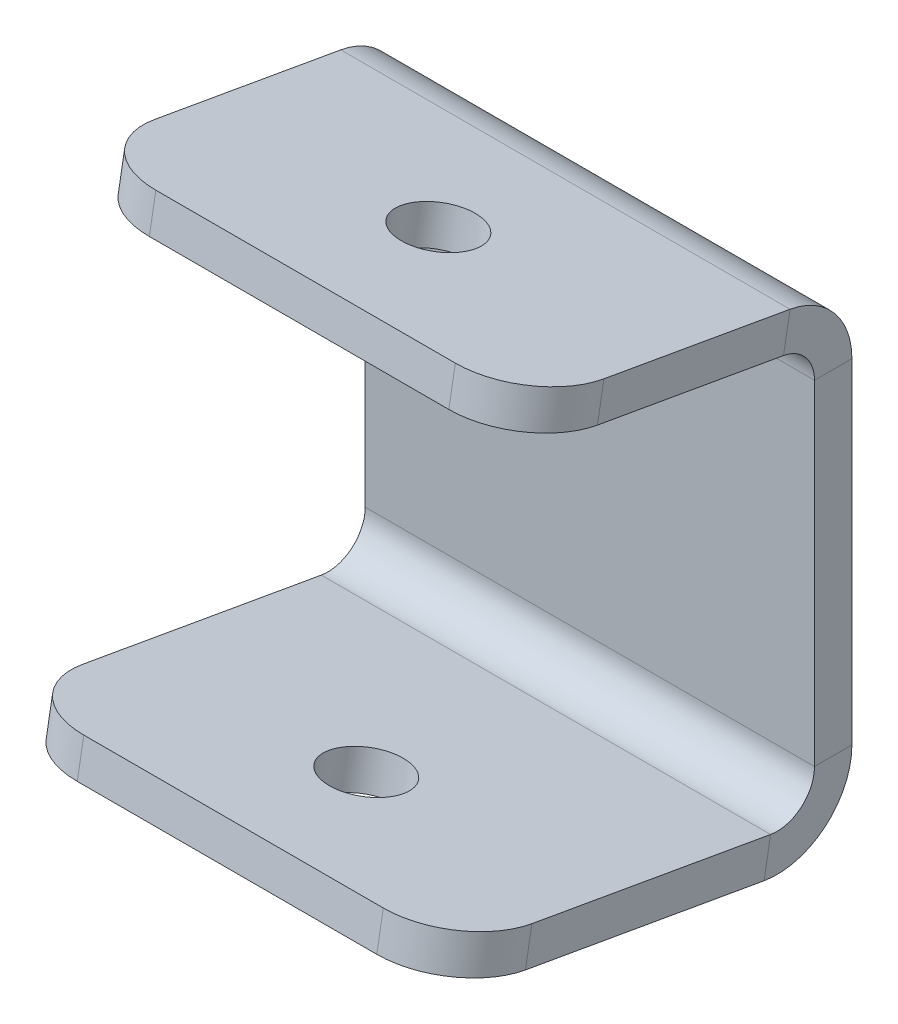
ISO-10303-21;
HEADER;
FILE_DESCRIPTION(('STEP AP214'),'2;1');
FILE_NAME('part.step','',(''),(''),'','','');
FILE_SCHEMA(('AUTOMOTIVE_DESIGN { 1 0 10303 214 1 1 1 1 }'));
ENDSEC;
DATA;
#1=APPLICATION_CONTEXT('core data for automotive mechanical design processes');
#2=APPLICATION_PROTOCOL_DEFINITION('international standard','automotive_design',2000,#1);
#3=PRODUCT_CONTEXT('',#1,'mechanical');
#4=PRODUCT('Part','Part','',(#3));
#5=PRODUCT_RELATED_PRODUCT_CATEGORY('part','',(#4));
#6=PRODUCT_DEFINITION_FORMATION('','',#4);
#7=PRODUCT_DEFINITION_CONTEXT('part definition',#1,'design');
#8=PRODUCT_DEFINITION('design','',#6,#7);
#9=PRODUCT_DEFINITION_SHAPE('','',#8);
#10=(LENGTH_UNIT() NAMED_UNIT(*) SI_UNIT(.MILLI.,.METRE.));
#11=(NAMED_UNIT(*) PLANE_ANGLE_UNIT() SI_UNIT($,.RADIAN.));
#12=(NAMED_UNIT(*) SI_UNIT($,.STERADIAN.) SOLID_ANGLE_UNIT());
#13=UNCERTAINTY_MEASURE_WITH_UNIT(LENGTH_MEASURE(1.E-05),#10,'distance_accuracy_value','');
#14=(GEOMETRIC_REPRESENTATION_CONTEXT(3) GLOBAL_UNCERTAINTY_ASSIGNED_CONTEXT((#13)) GLOBAL_UNIT_ASSIGNED_CONTEXT((#10,
#11,#12)) REPRESENTATION_CONTEXT('',''));
#15=CARTESIAN_POINT('',(0.,0.,0.));
#16=DIRECTION('',(0.,0.,1.));
#17=DIRECTION('',(1.,0.,0.));
#18=AXIS2_PLACEMENT_3D('',#15,#16,#17);
#19=CARTESIAN_POINT('',(20.,87.0812227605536,33.9852054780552));
#20=DIRECTION('',(0.,-0.984807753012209,0.173648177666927));
#21=DIRECTION('',(1.,0.,0.));
#22=AXIS2_PLACEMENT_3D('',#19,#20,#21);
#23=PLANE('',#22);
#24=CARTESIAN_POINT('',(0.,85.6920373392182,26.1067434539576));
#25=DIRECTION('',(0.,-0.984807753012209,0.173648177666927));
#26=DIRECTION('',(1.,0.,0.));
#27=AXIS2_PLACEMENT_3D('',#24,#25,#26);
#28=CIRCLE('',#27,5.00000000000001);
#29=CARTESIAN_POINT('',(5.00000000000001,85.6920373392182,26.1067434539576));
#30=VERTEX_POINT('',#29);
#31=EDGE_CURVE('E260',#30,#30,#28,.T.);
#32=ORIENTED_EDGE('',*,*,#31,.F.);
#33=EDGE_LOOP('',(#32));
#34=FACE_BOUND('',#33,.T.);
#35=DIRECTION('',(0.,-0.173648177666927,-0.984807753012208));
#36=VECTOR('',#35,1.);
#37=CARTESIAN_POINT('',(-30.,87.0812227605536,33.9852054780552));
#38=LINE('',#37,#36);
#39=CARTESIAN_POINT('',(-30.,87.0812227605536,33.9852054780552));
#40=VERTEX_POINT('',#39);
#41=CARTESIAN_POINT('',(-30.,82.6988896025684,9.13175911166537));
#42=VERTEX_POINT('',#41);
#43=EDGE_CURVE('E284',#40,#42,#38,.T.);
#44=ORIENTED_EDGE('',*,*,#43,.T.);
#45=DIRECTION('',(1.,0.,0.));
#46=VECTOR('',#45,1.);
#47=CARTESIAN_POINT('',(20.,82.6988896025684,9.13175911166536));
#48=LINE('',#47,#46);
#49=CARTESIAN_POINT('',(30.,82.6988896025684,9.13175911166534));
#50=VERTEX_POINT('',#49);
#51=EDGE_CURVE('E11',#42,#50,#48,.T.);
#52=ORIENTED_EDGE('',*,*,#51,.T.);
#53=DIRECTION('',(0.,0.173648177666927,0.984807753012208));
#54=VECTOR('',#53,1.);
#55=CARTESIAN_POINT('',(30.,66.5907377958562,-82.2221093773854));
#56=LINE('',#55,#54);
#57=CARTESIAN_POINT('',(30.,87.0812227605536,33.9852054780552));
#58=VERTEX_POINT('',#57);
#59=EDGE_CURVE('E286',#50,#58,#56,.T.);
#60=ORIENTED_EDGE('',*,*,#59,.T.);
#61=CARTESIAN_POINT('',(20.,87.0812227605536,33.9852054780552));
#62=DIRECTION('',(0.,-0.984807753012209,0.173648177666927));
#63=DIRECTION('',(1.,0.,0.));
#64=AXIS2_PLACEMENT_3D('',#61,#62,#63);
#65=CIRCLE('',#64,10.);
#66=CARTESIAN_POINT('',(20.,88.8177045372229,43.8332830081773));
#67=VERTEX_POINT('',#66);
#68=EDGE_CURVE('E276',#58,#67,#65,.T.);
#69=ORIENTED_EDGE('',*,*,#68,.T.);
#70=DIRECTION('',(1.,0.,0.));
#71=VECTOR('',#70,1.);
#72=CARTESIAN_POINT('',(-20.,88.8177045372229,43.8332830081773));
#73=LINE('',#72,#71);
#74=CARTESIAN_POINT('',(-20.,88.8177045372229,43.8332830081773));
#75=VERTEX_POINT('',#74);
#76=EDGE_CURVE('E278',#75,#67,#73,.T.);
#77=ORIENTED_EDGE('',*,*,#76,.F.);
#78=CARTESIAN_POINT('',(-20.,87.0812227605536,33.9852054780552));
#79=DIRECTION('',(0.,0.984807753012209,-0.173648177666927));
#80=DIRECTION('',(-1.,0.,0.));
#81=AXIS2_PLACEMENT_3D('',#78,#79,#80);
#82=CIRCLE('',#81,10.);
#83=EDGE_CURVE('E281',#40,#75,#82,.T.);
#84=ORIENTED_EDGE('',*,*,#83,.F.);
#85=EDGE_LOOP('',(#44,#52,#60,#69,#77,#84));
#86=FACE_BOUND('',#85,.T.);
#87=ADVANCED_FACE('F30',(#34,#86),#23,.T.);
#88=CARTESIAN_POINT('',(20.,92.0052615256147,33.1169645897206));
#89=DIRECTION('',(0.,-0.984807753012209,0.173648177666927));
#90=DIRECTION('',(1.,0.,0.));
#91=AXIS2_PLACEMENT_3D('',#88,#89,#90);
#92=PLANE('',#91);
#93=DIRECTION('',(1.,0.,0.));
#94=VECTOR('',#93,1.);
#95=CARTESIAN_POINT('',(20.,87.6229283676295,8.26351822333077));
#96=LINE('',#95,#94);
#97=CARTESIAN_POINT('',(-30.,87.6229283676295,8.26351822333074));
#98=VERTEX_POINT('',#97);
#99=CARTESIAN_POINT('',(30.,87.6229283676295,8.26351822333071));
#100=VERTEX_POINT('',#99);
#101=EDGE_CURVE('E53',#98,#100,#96,.T.);
#102=ORIENTED_EDGE('',*,*,#101,.F.);
#103=DIRECTION('',(0.,-0.173648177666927,-0.984807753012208));
#104=VECTOR('',#103,1.);
#105=CARTESIAN_POINT('',(-30.,92.0052615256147,33.1169645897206));
#106=LINE('',#105,#104);
#107=CARTESIAN_POINT('',(-30.,92.0052615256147,33.1169645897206));
#108=VERTEX_POINT('',#107);
#109=EDGE_CURVE('E272',#108,#98,#106,.T.);
#110=ORIENTED_EDGE('',*,*,#109,.F.);
#111=CARTESIAN_POINT('',(-20.,92.0052615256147,33.1169645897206));
#112=DIRECTION('',(0.,0.984807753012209,-0.173648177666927));
#113=DIRECTION('',(-1.,0.,0.));
#114=AXIS2_PLACEMENT_3D('',#111,#112,#113);
#115=CIRCLE('',#114,10.);
#116=CARTESIAN_POINT('',(-20.,93.741743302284,42.9650421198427));
#117=VERTEX_POINT('',#116);
#118=EDGE_CURVE('E269',#108,#117,#115,.T.);
#119=ORIENTED_EDGE('',*,*,#118,.T.);
#120=DIRECTION('',(1.,0.,0.));
#121=VECTOR('',#120,1.);
#122=CARTESIAN_POINT('',(-20.,93.741743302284,42.9650421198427));
#123=LINE('',#122,#121);
#124=CARTESIAN_POINT('',(20.,93.741743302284,42.9650421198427));
#125=VERTEX_POINT('',#124);
#126=EDGE_CURVE('E266',#117,#125,#123,.T.);
#127=ORIENTED_EDGE('',*,*,#126,.T.);
#128=CARTESIAN_POINT('',(20.,92.0052615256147,33.1169645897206));
#129=DIRECTION('',(0.,-0.984807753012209,0.173648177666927));
#130=DIRECTION('',(1.,0.,0.));
#131=AXIS2_PLACEMENT_3D('',#128,#129,#130);
#132=CIRCLE('',#131,10.);
#133=CARTESIAN_POINT('',(30.,92.0052615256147,33.1169645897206));
#134=VERTEX_POINT('',#133);
#135=EDGE_CURVE('E263',#134,#125,#132,.T.);
#136=ORIENTED_EDGE('',*,*,#135,.F.);
#137=DIRECTION('',(0.,0.173648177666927,0.984807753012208));
#138=VECTOR('',#137,1.);
#139=CARTESIAN_POINT('',(30.,71.5147765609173,-83.09035026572));
#140=LINE('',#139,#138);
#141=EDGE_CURVE('E274',#100,#134,#140,.T.);
#142=ORIENTED_EDGE('',*,*,#141,.F.);
#143=EDGE_LOOP('',(#102,#110,#119,#127,#136,#142));
#144=FACE_BOUND('',#143,.T.);
#145=CARTESIAN_POINT('',(0.,90.6160761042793,25.2385025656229));
#146=DIRECTION('',(0.,-0.984807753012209,0.173648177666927));
#147=DIRECTION('',(1.,0.,0.));
#148=AXIS2_PLACEMENT_3D('',#145,#146,#147);
#149=CIRCLE('',#148,5.00000000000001);
#150=CARTESIAN_POINT('',(5.00000000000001,90.6160761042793,25.2385025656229));
#151=VERTEX_POINT('',#150);
#152=EDGE_CURVE('E257',#151,#151,#149,.T.);
#153=ORIENTED_EDGE('',*,*,#152,.T.);
#154=EDGE_LOOP('',(#153));
#155=FACE_BOUND('',#154,.T.);
#156=ADVANCED_FACE('F375',(#144,#155),#92,.F.);
#157=CARTESIAN_POINT('',(-30.,87.0812227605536,33.9852054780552));
#158=DIRECTION('',(1.,0.,0.));
#159=DIRECTION('',(0.,0.173648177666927,0.984807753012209));
#160=AXIS2_PLACEMENT_3D('',#157,#158,#159);
#161=PLANE('',#160);
#162=DIRECTION('',(0.,0.98480775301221,-0.17364817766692));
#163=VECTOR('',#162,1.);
#164=CARTESIAN_POINT('',(-30.,82.6988896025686,9.13175911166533));
#165=LINE('',#164,#163);
#166=EDGE_CURVE('E45',#42,#98,#165,.T.);
#167=ORIENTED_EDGE('',*,*,#166,.F.);
#168=ORIENTED_EDGE('',*,*,#43,.F.);
#169=DIRECTION('',(0.,0.984807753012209,-0.173648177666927));
#170=VECTOR('',#169,1.);
#171=CARTESIAN_POINT('',(-30.,87.0812227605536,33.9852054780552));
#172=LINE('',#171,#170);
#173=EDGE_CURVE('E291',#40,#108,#172,.T.);
#174=ORIENTED_EDGE('',*,*,#173,.T.);
#175=ORIENTED_EDGE('',*,*,#109,.T.);
#176=EDGE_LOOP('',(#167,#168,#174,#175));
#177=FACE_BOUND('',#176,.T.);
#178=ADVANCED_FACE('F381',(#177),#161,.F.);
#179=CARTESIAN_POINT('',(30.,66.5907377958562,-82.2221093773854));
#180=DIRECTION('',(-1.,0.,0.));
#181=DIRECTION('',(0.,-0.984807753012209,0.173648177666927));
#182=AXIS2_PLACEMENT_3D('',#179,#180,#181);
#183=PLANE('',#182);
#184=DIRECTION('',(0.,-0.98480775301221,0.17364817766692));
#185=VECTOR('',#184,1.);
#186=CARTESIAN_POINT('',(30.,82.6988896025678,9.13175911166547));
#187=LINE('',#186,#185);
#188=EDGE_CURVE('E38',#100,#50,#187,.T.);
#189=ORIENTED_EDGE('',*,*,#188,.F.);
#190=ORIENTED_EDGE('',*,*,#141,.T.);
#191=DIRECTION('',(0.,0.984807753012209,-0.173648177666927));
#192=VECTOR('',#191,1.);
#193=CARTESIAN_POINT('',(30.,87.0812227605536,33.9852054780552));
#194=LINE('',#193,#192);
#195=EDGE_CURVE('E288',#58,#134,#194,.T.);
#196=ORIENTED_EDGE('',*,*,#195,.F.);
#197=ORIENTED_EDGE('',*,*,#59,.F.);
#198=EDGE_LOOP('',(#189,#190,#196,#197));
#199=FACE_BOUND('',#198,.T.);
#200=ADVANCED_FACE('F387',(#199),#183,.F.);
#201=CARTESIAN_POINT('',(20.,87.0812227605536,33.9852054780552));
#202=DIRECTION('',(0.,0.984807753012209,-0.173648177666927));
#203=DIRECTION('',(-1.,0.,0.));
#204=AXIS2_PLACEMENT_3D('',#201,#202,#203);
#205=CYLINDRICAL_SURFACE('',#204,10.);
#206=ORIENTED_EDGE('',*,*,#135,.T.);
#207=DIRECTION('',(0.,0.984807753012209,-0.173648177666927));
#208=VECTOR('',#207,1.);
#209=CARTESIAN_POINT('',(20.,88.8177045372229,43.8332830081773));
#210=LINE('',#209,#208);
#211=EDGE_CURVE('E295',#67,#125,#210,.T.);
#212=ORIENTED_EDGE('',*,*,#211,.F.);
#213=ORIENTED_EDGE('',*,*,#68,.F.);
#214=ORIENTED_EDGE('',*,*,#195,.T.);
#215=EDGE_LOOP('',(#206,#212,#213,#214));
#216=FACE_BOUND('',#215,.T.);
#217=ADVANCED_FACE('F32',(#216),#205,.T.);
#218=CARTESIAN_POINT('',(-20.,88.8177045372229,43.8332830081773));
#219=DIRECTION('',(0.,0.173648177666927,0.984807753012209));
#220=DIRECTION('',(0.,-0.984807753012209,0.173648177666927));
#221=AXIS2_PLACEMENT_3D('',#218,#219,#220);
#222=PLANE('',#221);
#223=ORIENTED_EDGE('',*,*,#126,.F.);
#224=DIRECTION('',(0.,0.984807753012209,-0.173648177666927));
#225=VECTOR('',#224,1.);
#226=CARTESIAN_POINT('',(-20.,88.8177045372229,43.8332830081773));
#227=LINE('',#226,#225);
#228=EDGE_CURVE('E293',#75,#117,#227,.T.);
#229=ORIENTED_EDGE('',*,*,#228,.F.);
#230=ORIENTED_EDGE('',*,*,#76,.T.);
#231=ORIENTED_EDGE('',*,*,#211,.T.);
#232=EDGE_LOOP('',(#223,#229,#230,#231));
#233=FACE_BOUND('',#232,.T.);
#234=ADVANCED_FACE('F395',(#233),#222,.T.);
#235=CARTESIAN_POINT('',(-20.,87.0812227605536,33.9852054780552));
#236=DIRECTION('',(0.,0.984807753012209,-0.173648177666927));
#237=DIRECTION('',(-1.,0.,0.));
#238=AXIS2_PLACEMENT_3D('',#235,#236,#237);
#239=CYLINDRICAL_SURFACE('',#238,10.);
#240=ORIENTED_EDGE('',*,*,#118,.F.);
#241=ORIENTED_EDGE('',*,*,#173,.F.);
#242=ORIENTED_EDGE('',*,*,#83,.T.);
#243=ORIENTED_EDGE('',*,*,#228,.T.);
#244=EDGE_LOOP('',(#240,#241,#242,#243));
#245=FACE_BOUND('',#244,.T.);
#246=ADVANCED_FACE('F392',(#245),#239,.T.);
#247=CARTESIAN_POINT('',(0.,85.6920373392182,26.1067434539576));
#248=DIRECTION('',(0.,0.984807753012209,-0.173648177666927));
#249=DIRECTION('',(-1.,0.,0.));
#250=AXIS2_PLACEMENT_3D('',#247,#248,#249);
#251=CYLINDRICAL_SURFACE('',#250,5.00000000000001);
#252=ORIENTED_EDGE('',*,*,#31,.T.);
#253=EDGE_LOOP('',(#252));
#254=FACE_BOUND('',#253,.T.);
#255=ORIENTED_EDGE('',*,*,#152,.F.);
#256=EDGE_LOOP('',(#255));
#257=FACE_BOUND('',#256,.T.);
#258=ADVANCED_FACE('F394',(#254,#257),#251,.F.);
#259=CARTESIAN_POINT('',(20.,13.3039931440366,-73.4674318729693));
#260=DIRECTION('',(0.,0.984807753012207,-0.173648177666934));
#261=DIRECTION('',(1.,0.,0.));
#262=AXIS2_PLACEMENT_3D('',#259,#260,#261);
#263=PLANE('',#262);
#264=CARTESIAN_POINT('',(0.,32.4052926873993,34.8614209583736));
#265=DIRECTION('',(0.,0.984807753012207,-0.173648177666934));
#266=DIRECTION('',(1.,0.,0.));
#267=AXIS2_PLACEMENT_3D('',#264,#265,#266);
#268=CIRCLE('',#267,5.);
#269=CARTESIAN_POINT('',(5.,32.4052926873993,34.8614209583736));
#270=VERTEX_POINT('',#269);
#271=EDGE_CURVE('E205',#270,#270,#268,.T.);
#272=ORIENTED_EDGE('',*,*,#271,.F.);
#273=EDGE_LOOP('',(#272));
#274=FACE_BOUND('',#273,.T.);
#275=DIRECTION('',(0.,-0.173648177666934,-0.984807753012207));
#276=VECTOR('',#275,1.);
#277=CARTESIAN_POINT('',(30.,33.7944781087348,42.7398829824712));
#278=LINE('',#277,#276);
#279=CARTESIAN_POINT('',(30.,33.7944781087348,42.7398829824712));
#280=VERTEX_POINT('',#279);
#281=CARTESIAN_POINT('',(30.,28.1746476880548,10.8682408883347));
#282=VERTEX_POINT('',#281);
#283=EDGE_CURVE('E233',#280,#282,#278,.T.);
#284=ORIENTED_EDGE('',*,*,#283,.T.);
#285=DIRECTION('',(-1.,0.,0.));
#286=VECTOR('',#285,1.);
#287=CARTESIAN_POINT('',(20.,28.1746476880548,10.8682408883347));
#288=LINE('',#287,#286);
#289=CARTESIAN_POINT('',(-30.,28.1746476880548,10.8682408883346));
#290=VERTEX_POINT('',#289);
#291=EDGE_CURVE('E248',#282,#290,#288,.T.);
#292=ORIENTED_EDGE('',*,*,#291,.T.);
#293=DIRECTION('',(0.,0.173648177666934,0.984807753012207));
#294=VECTOR('',#293,1.);
#295=CARTESIAN_POINT('',(-30.,13.3039931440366,-73.4674318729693));
#296=LINE('',#295,#294);
#297=CARTESIAN_POINT('',(-30.,33.7944781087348,42.7398829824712));
#298=VERTEX_POINT('',#297);
#299=EDGE_CURVE('E222',#290,#298,#296,.T.);
#300=ORIENTED_EDGE('',*,*,#299,.T.);
#301=CARTESIAN_POINT('',(-20.,33.7944781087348,42.7398829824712));
#302=DIRECTION('',(0.,-0.984807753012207,0.173648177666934));
#303=DIRECTION('',(-1.,0.,0.));
#304=AXIS2_PLACEMENT_3D('',#301,#302,#303);
#305=CIRCLE('',#304,10.);
#306=CARTESIAN_POINT('',(-20.,35.5309598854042,52.5879605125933));
#307=VERTEX_POINT('',#306);
#308=EDGE_CURVE('E224',#307,#298,#305,.T.);
#309=ORIENTED_EDGE('',*,*,#308,.F.);
#310=DIRECTION('',(-1.,0.,0.));
#311=VECTOR('',#310,1.);
#312=CARTESIAN_POINT('',(20.,35.5309598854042,52.5879605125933));
#313=LINE('',#312,#311);
#314=CARTESIAN_POINT('',(20.,35.5309598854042,52.5879605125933));
#315=VERTEX_POINT('',#314);
#316=EDGE_CURVE('E227',#315,#307,#313,.T.);
#317=ORIENTED_EDGE('',*,*,#316,.F.);
#318=CARTESIAN_POINT('',(20.,33.7944781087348,42.7398829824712));
#319=DIRECTION('',(0.,-0.984807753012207,0.173648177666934));
#320=DIRECTION('',(-1.,0.,0.));
#321=AXIS2_PLACEMENT_3D('',#318,#319,#320);
#322=CIRCLE('',#321,10.);
#323=EDGE_CURVE('E230',#280,#315,#322,.T.);
#324=ORIENTED_EDGE('',*,*,#323,.F.);
#325=EDGE_LOOP('',(#284,#292,#300,#309,#317,#324));
#326=FACE_BOUND('',#325,.T.);
#327=ADVANCED_FACE('F337',(#274,#326),#263,.T.);
#328=CARTESIAN_POINT('',(20.,8.37995437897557,-72.5991909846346));
#329=DIRECTION('',(0.,0.984807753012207,-0.173648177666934));
#330=DIRECTION('',(1.,0.,0.));
#331=AXIS2_PLACEMENT_3D('',#328,#329,#330);
#332=PLANE('',#331);
#333=DIRECTION('',(-1.,0.,0.));
#334=VECTOR('',#333,1.);
#335=CARTESIAN_POINT('',(20.,23.2506089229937,11.7364817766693));
#336=LINE('',#335,#334);
#337=CARTESIAN_POINT('',(30.,23.2506089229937,11.7364817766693));
#338=VERTEX_POINT('',#337);
#339=CARTESIAN_POINT('',(-30.,23.2506089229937,11.7364817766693));
#340=VERTEX_POINT('',#339);
#341=EDGE_CURVE('E245',#338,#340,#336,.T.);
#342=ORIENTED_EDGE('',*,*,#341,.F.);
#343=DIRECTION('',(0.,-0.173648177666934,-0.984807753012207));
#344=VECTOR('',#343,1.);
#345=CARTESIAN_POINT('',(30.,28.8704393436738,43.6081238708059));
#346=LINE('',#345,#344);
#347=CARTESIAN_POINT('',(30.,28.8704393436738,43.6081238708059));
#348=VERTEX_POINT('',#347);
#349=EDGE_CURVE('E219',#348,#338,#346,.T.);
#350=ORIENTED_EDGE('',*,*,#349,.F.);
#351=CARTESIAN_POINT('',(20.,28.8704393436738,43.6081238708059));
#352=DIRECTION('',(0.,-0.984807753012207,0.173648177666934));
#353=DIRECTION('',(-1.,0.,0.));
#354=AXIS2_PLACEMENT_3D('',#351,#352,#353);
#355=CIRCLE('',#354,10.);
#356=CARTESIAN_POINT('',(20.,30.6069211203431,53.456201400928));
#357=VERTEX_POINT('',#356);
#358=EDGE_CURVE('E216',#348,#357,#355,.T.);
#359=ORIENTED_EDGE('',*,*,#358,.T.);
#360=DIRECTION('',(-1.,0.,0.));
#361=VECTOR('',#360,1.);
#362=CARTESIAN_POINT('',(20.,30.6069211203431,53.456201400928));
#363=LINE('',#362,#361);
#364=CARTESIAN_POINT('',(-20.,30.6069211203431,53.456201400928));
#365=VERTEX_POINT('',#364);
#366=EDGE_CURVE('E213',#357,#365,#363,.T.);
#367=ORIENTED_EDGE('',*,*,#366,.T.);
#368=CARTESIAN_POINT('',(-20.,28.8704393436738,43.6081238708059));
#369=DIRECTION('',(0.,-0.984807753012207,0.173648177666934));
#370=DIRECTION('',(-1.,0.,0.));
#371=AXIS2_PLACEMENT_3D('',#368,#369,#370);
#372=CIRCLE('',#371,10.);
#373=CARTESIAN_POINT('',(-30.,28.8704393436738,43.6081238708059));
#374=VERTEX_POINT('',#373);
#375=EDGE_CURVE('E210',#365,#374,#372,.T.);
#376=ORIENTED_EDGE('',*,*,#375,.T.);
#377=DIRECTION('',(0.,0.173648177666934,0.984807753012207));
#378=VECTOR('',#377,1.);
#379=CARTESIAN_POINT('',(-30.,8.37995437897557,-72.5991909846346));
#380=LINE('',#379,#378);
#381=EDGE_CURVE('E208',#340,#374,#380,.T.);
#382=ORIENTED_EDGE('',*,*,#381,.F.);
#383=EDGE_LOOP('',(#342,#350,#359,#367,#376,#382));
#384=FACE_BOUND('',#383,.T.);
#385=CARTESIAN_POINT('',(0.,27.4812539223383,35.7296618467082));
#386=DIRECTION('',(0.,0.984807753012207,-0.173648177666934));
#387=DIRECTION('',(1.,0.,0.));
#388=AXIS2_PLACEMENT_3D('',#385,#386,#387);
#389=CIRCLE('',#388,5.);
#390=CARTESIAN_POINT('',(5.,27.4812539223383,35.7296618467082));
#391=VERTEX_POINT('',#390);
#392=EDGE_CURVE('E178',#391,#391,#389,.T.);
#393=ORIENTED_EDGE('',*,*,#392,.T.);
#394=EDGE_LOOP('',(#393));
#395=FACE_BOUND('',#394,.T.);
#396=ADVANCED_FACE('F348',(#384,#395),#332,.F.);
#397=CARTESIAN_POINT('',(-30.,13.3039931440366,-73.4674318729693));
#398=DIRECTION('',(1.,0.,0.));
#399=DIRECTION('',(0.,-0.173648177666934,-0.984807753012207));
#400=AXIS2_PLACEMENT_3D('',#397,#398,#399);
#401=PLANE('',#400);
#402=DIRECTION('',(0.,0.984807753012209,-0.173648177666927));
#403=VECTOR('',#402,1.);
#404=CARTESIAN_POINT('',(-30.,28.1746476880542,10.8682408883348));
#405=LINE('',#404,#403);
#406=EDGE_CURVE('E251',#340,#290,#405,.T.);
#407=ORIENTED_EDGE('',*,*,#406,.F.);
#408=ORIENTED_EDGE('',*,*,#381,.T.);
#409=DIRECTION('',(0.,-0.984807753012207,0.173648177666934));
#410=VECTOR('',#409,1.);
#411=CARTESIAN_POINT('',(-30.,33.7944781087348,42.7398829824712));
#412=LINE('',#411,#410);
#413=EDGE_CURVE('E242',#298,#374,#412,.T.);
#414=ORIENTED_EDGE('',*,*,#413,.F.);
#415=ORIENTED_EDGE('',*,*,#299,.F.);
#416=EDGE_LOOP('',(#407,#408,#414,#415));
#417=FACE_BOUND('',#416,.T.);
#418=ADVANCED_FACE('F346',(#417),#401,.F.);
#419=CARTESIAN_POINT('',(-20.,33.7944781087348,42.7398829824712));
#420=DIRECTION('',(0.,-0.984807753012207,0.173648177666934));
#421=DIRECTION('',(-1.,0.,0.));
#422=AXIS2_PLACEMENT_3D('',#419,#420,#421);
#423=CYLINDRICAL_SURFACE('',#422,10.);
#424=ORIENTED_EDGE('',*,*,#375,.F.);
#425=DIRECTION('',(0.,-0.984807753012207,0.173648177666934));
#426=VECTOR('',#425,1.);
#427=CARTESIAN_POINT('',(-20.,35.5309598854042,52.5879605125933));
#428=LINE('',#427,#426);
#429=EDGE_CURVE('E240',#307,#365,#428,.T.);
#430=ORIENTED_EDGE('',*,*,#429,.F.);
#431=ORIENTED_EDGE('',*,*,#308,.T.);
#432=ORIENTED_EDGE('',*,*,#413,.T.);
#433=EDGE_LOOP('',(#424,#430,#431,#432));
#434=FACE_BOUND('',#433,.T.);
#435=ADVANCED_FACE('F354',(#434),#423,.T.);
#436=CARTESIAN_POINT('',(20.,35.5309598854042,52.5879605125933));
#437=DIRECTION('',(0.,0.173648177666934,0.984807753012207));
#438=DIRECTION('',(1.,0.,0.));
#439=AXIS2_PLACEMENT_3D('',#436,#437,#438);
#440=PLANE('',#439);
#441=ORIENTED_EDGE('',*,*,#366,.F.);
#442=DIRECTION('',(0.,-0.984807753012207,0.173648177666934));
#443=VECTOR('',#442,1.);
#444=CARTESIAN_POINT('',(20.,35.5309598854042,52.5879605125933));
#445=LINE('',#444,#443);
#446=EDGE_CURVE('E238',#315,#357,#445,.T.);
#447=ORIENTED_EDGE('',*,*,#446,.F.);
#448=ORIENTED_EDGE('',*,*,#316,.T.);
#449=ORIENTED_EDGE('',*,*,#429,.T.);
#450=EDGE_LOOP('',(#441,#447,#448,#449));
#451=FACE_BOUND('',#450,.T.);
#452=ADVANCED_FACE('F357',(#451),#440,.T.);
#453=CARTESIAN_POINT('',(20.,33.7944781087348,42.7398829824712));
#454=DIRECTION('',(0.,-0.984807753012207,0.173648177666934));
#455=DIRECTION('',(-1.,0.,0.));
#456=AXIS2_PLACEMENT_3D('',#453,#454,#455);
#457=CYLINDRICAL_SURFACE('',#456,10.);
#458=ORIENTED_EDGE('',*,*,#358,.F.);
#459=DIRECTION('',(0.,-0.984807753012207,0.173648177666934));
#460=VECTOR('',#459,1.);
#461=CARTESIAN_POINT('',(30.,33.7944781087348,42.7398829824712));
#462=LINE('',#461,#460);
#463=EDGE_CURVE('E236',#280,#348,#462,.T.);
#464=ORIENTED_EDGE('',*,*,#463,.F.);
#465=ORIENTED_EDGE('',*,*,#323,.T.);
#466=ORIENTED_EDGE('',*,*,#446,.T.);
#467=EDGE_LOOP('',(#458,#464,#465,#466));
#468=FACE_BOUND('',#467,.T.);
#469=ADVANCED_FACE('F360',(#468),#457,.T.);
#470=CARTESIAN_POINT('',(30.,33.7944781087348,42.7398829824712));
#471=DIRECTION('',(-1.,0.,0.));
#472=DIRECTION('',(0.,0.984807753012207,-0.173648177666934));
#473=AXIS2_PLACEMENT_3D('',#470,#471,#472);
#474=PLANE('',#473);
#475=DIRECTION('',(0.,-0.984807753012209,0.173648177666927));
#476=VECTOR('',#475,1.);
#477=CARTESIAN_POINT('',(30.,28.174647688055,10.8682408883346));
#478=LINE('',#477,#476);
#479=EDGE_CURVE('E254',#282,#338,#478,.T.);
#480=ORIENTED_EDGE('',*,*,#479,.F.);
#481=ORIENTED_EDGE('',*,*,#283,.F.);
#482=ORIENTED_EDGE('',*,*,#463,.T.);
#483=ORIENTED_EDGE('',*,*,#349,.T.);
#484=EDGE_LOOP('',(#480,#481,#482,#483));
#485=FACE_BOUND('',#484,.T.);
#486=ADVANCED_FACE('F362',(#485),#474,.F.);
#487=CARTESIAN_POINT('',(0.,32.4052926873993,34.8614209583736));
#488=DIRECTION('',(0.,-0.984807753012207,0.173648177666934));
#489=DIRECTION('',(-1.,0.,0.));
#490=AXIS2_PLACEMENT_3D('',#487,#488,#489);
#491=CYLINDRICAL_SURFACE('',#490,5.);
#492=ORIENTED_EDGE('',*,*,#271,.T.);
#493=EDGE_LOOP('',(#492));
#494=FACE_BOUND('',#493,.T.);
#495=ORIENTED_EDGE('',*,*,#392,.F.);
#496=EDGE_LOOP('',(#495));
#497=FACE_BOUND('',#496,.T.);
#498=ADVANCED_FACE('F364',(#494,#497),#491,.F.);
#499=CARTESIAN_POINT('',(20.,110.,0.));
#500=DIRECTION('',(0.,0.,1.));
#501=DIRECTION('',(1.,0.,0.));
#502=AXIS2_PLACEMENT_3D('',#499,#500,#501);
#503=PLANE('',#502);
#504=DIRECTION('',(0.,-1.,0.));
#505=VECTOR('',#504,1.);
#506=CARTESIAN_POINT('',(-30.,110.,0.));
#507=LINE('',#506,#505);
#508=CARTESIAN_POINT('',(-30.,77.7748508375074,0.));
#509=VERTEX_POINT('',#508);
#510=CARTESIAN_POINT('',(-30.,33.0986864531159,0.));
#511=VERTEX_POINT('',#510);
#512=EDGE_CURVE('E187',#509,#511,#507,.T.);
#513=ORIENTED_EDGE('',*,*,#512,.F.);
#514=DIRECTION('',(1.,0.,0.));
#515=VECTOR('',#514,1.);
#516=CARTESIAN_POINT('',(20.,77.7748508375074,0.));
#517=LINE('',#516,#515);
#518=CARTESIAN_POINT('',(30.,77.7748508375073,0.));
#519=VERTEX_POINT('',#518);
#520=EDGE_CURVE('E158',#509,#519,#517,.T.);
#521=ORIENTED_EDGE('',*,*,#520,.T.);
#522=DIRECTION('',(0.,1.,0.));
#523=VECTOR('',#522,1.);
#524=CARTESIAN_POINT('',(30.,-7.99999999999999,0.));
#525=LINE('',#524,#523);
#526=CARTESIAN_POINT('',(30.,33.0986864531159,0.));
#527=VERTEX_POINT('',#526);
#528=EDGE_CURVE('E182',#527,#519,#525,.T.);
#529=ORIENTED_EDGE('',*,*,#528,.F.);
#530=DIRECTION('',(-1.,0.,0.));
#531=VECTOR('',#530,1.);
#532=CARTESIAN_POINT('',(20.,33.0986864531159,0.));
#533=LINE('',#532,#531);
#534=EDGE_CURVE('E194',#527,#511,#533,.T.);
#535=ORIENTED_EDGE('',*,*,#534,.T.);
#536=EDGE_LOOP('',(#513,#521,#529,#535));
#537=FACE_BOUND('',#536,.T.);
#538=ADVANCED_FACE('F322',(#537),#503,.F.);
#539=CARTESIAN_POINT('',(-30.,110.,5.));
#540=DIRECTION('',(1.,0.,0.));
#541=DIRECTION('',(0.,1.,0.));
#542=AXIS2_PLACEMENT_3D('',#539,#540,#541);
#543=PLANE('',#542);
#544=DIRECTION('',(0.,-1.,0.));
#545=VECTOR('',#544,1.);
#546=CARTESIAN_POINT('',(-30.,110.,5.));
#547=LINE('',#546,#545);
#548=CARTESIAN_POINT('',(-30.,77.7748508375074,5.00000000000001));
#549=VERTEX_POINT('',#548);
#550=CARTESIAN_POINT('',(-30.,33.0986864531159,5.));
#551=VERTEX_POINT('',#550);
#552=EDGE_CURVE('E174',#549,#551,#547,.T.);
#553=ORIENTED_EDGE('',*,*,#552,.F.);
#554=DIRECTION('',(0.,0.,-1.));
#555=VECTOR('',#554,1.);
#556=CARTESIAN_POINT('',(-30.,77.7748508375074,4.99999999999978));
#557=LINE('',#556,#555);
#558=EDGE_CURVE('E146',#549,#509,#557,.T.);
#559=ORIENTED_EDGE('',*,*,#558,.T.);
#560=ORIENTED_EDGE('',*,*,#512,.T.);
#561=DIRECTION('',(0.,0.,1.));
#562=VECTOR('',#561,1.);
#563=CARTESIAN_POINT('',(-30.,33.0986864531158,4.99999999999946));
#564=LINE('',#563,#562);
#565=EDGE_CURVE('E181',#511,#551,#564,.T.);
#566=ORIENTED_EDGE('',*,*,#565,.T.);
#567=EDGE_LOOP('',(#553,#559,#560,#566));
#568=FACE_BOUND('',#567,.T.);
#569=ADVANCED_FACE('F180',(#568),#543,.F.);
#570=CARTESIAN_POINT('',(30.,-7.99999999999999,5.));
#571=DIRECTION('',(-1.,0.,0.));
#572=DIRECTION('',(0.,0.,1.));
#573=AXIS2_PLACEMENT_3D('',#570,#571,#572);
#574=PLANE('',#573);
#575=ORIENTED_EDGE('',*,*,#528,.T.);
#576=DIRECTION('',(0.,0.,1.));
#577=VECTOR('',#576,1.);
#578=CARTESIAN_POINT('',(30.,77.7748508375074,5.0000000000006));
#579=LINE('',#578,#577);
#580=CARTESIAN_POINT('',(30.,77.7748508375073,5.00000000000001));
#581=VERTEX_POINT('',#580);
#582=EDGE_CURVE('E159',#519,#581,#579,.T.);
#583=ORIENTED_EDGE('',*,*,#582,.T.);
#584=DIRECTION('',(0.,1.,0.));
#585=VECTOR('',#584,1.);
#586=CARTESIAN_POINT('',(30.,-7.99999999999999,5.));
#587=LINE('',#586,#585);
#588=CARTESIAN_POINT('',(30.,33.0986864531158,5.));
#589=VERTEX_POINT('',#588);
#590=EDGE_CURVE('E177',#589,#581,#587,.T.);
#591=ORIENTED_EDGE('',*,*,#590,.F.);
#592=DIRECTION('',(0.,0.,-1.));
#593=VECTOR('',#592,1.);
#594=CARTESIAN_POINT('',(30.,33.0986864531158,5.00000000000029));
#595=LINE('',#594,#593);
#596=EDGE_CURVE('E184',#589,#527,#595,.T.);
#597=ORIENTED_EDGE('',*,*,#596,.T.);
#598=EDGE_LOOP('',(#575,#583,#591,#597));
#599=FACE_BOUND('',#598,.T.);
#600=ADVANCED_FACE('F328',(#599),#574,.F.);
#601=CARTESIAN_POINT('',(20.,110.,5.));
#602=DIRECTION('',(0.,0.,1.));
#603=DIRECTION('',(1.,0.,0.));
#604=AXIS2_PLACEMENT_3D('',#601,#602,#603);
#605=PLANE('',#604);
#606=DIRECTION('',(1.,0.,0.));
#607=VECTOR('',#606,1.);
#608=CARTESIAN_POINT('',(20.,77.7748508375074,5.));
#609=LINE('',#608,#607);
#610=EDGE_CURVE('E165',#549,#581,#609,.T.);
#611=ORIENTED_EDGE('',*,*,#610,.F.);
#612=ORIENTED_EDGE('',*,*,#552,.T.);
#613=DIRECTION('',(-1.,0.,0.));
#614=VECTOR('',#613,1.);
#615=CARTESIAN_POINT('',(20.,33.0986864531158,5.));
#616=LINE('',#615,#614);
#617=EDGE_CURVE('E197',#589,#551,#616,.T.);
#618=ORIENTED_EDGE('',*,*,#617,.F.);
#619=ORIENTED_EDGE('',*,*,#590,.T.);
#620=EDGE_LOOP('',(#611,#612,#618,#619));
#621=FACE_BOUND('',#620,.T.);
#622=ADVANCED_FACE('F172',(#621),#605,.T.);
#623=CARTESIAN_POINT('',(-30.,33.0986864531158,10.));
#624=DIRECTION('',(1.,0.,0.));
#625=DIRECTION('',(0.,0.,-1.));
#626=AXIS2_PLACEMENT_3D('',#623,#624,#625);
#627=PLANE('',#626);
#628=ORIENTED_EDGE('',*,*,#406,.T.);
#629=CARTESIAN_POINT('',(-30.,33.0986864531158,10.));
#630=DIRECTION('',(1.,0.,0.));
#631=DIRECTION('',(0.,0.,-1.));
#632=AXIS2_PLACEMENT_3D('',#629,#630,#631);
#633=CIRCLE('',#632,5.);
#634=EDGE_CURVE('E312',#551,#290,#633,.F.);
#635=ORIENTED_EDGE('',*,*,#634,.F.);
#636=ORIENTED_EDGE('',*,*,#565,.F.);
#637=CARTESIAN_POINT('',(-30.,33.0986864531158,10.));
#638=DIRECTION('',(1.,0.,0.));
#639=DIRECTION('',(0.,0.,-1.));
#640=AXIS2_PLACEMENT_3D('',#637,#638,#639);
#641=CIRCLE('',#640,10.);
#642=EDGE_CURVE('E317',#511,#340,#641,.F.);
#643=ORIENTED_EDGE('',*,*,#642,.T.);
#644=EDGE_LOOP('',(#628,#635,#636,#643));
#645=FACE_BOUND('',#644,.T.);
#646=ADVANCED_FACE('F343',(#645),#627,.F.);
#647=CARTESIAN_POINT('',(30.,33.0986864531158,10.));
#648=DIRECTION('',(-1.,0.,0.));
#649=DIRECTION('',(0.,0.,1.));
#650=AXIS2_PLACEMENT_3D('',#647,#648,#649);
#651=PLANE('',#650);
#652=ORIENTED_EDGE('',*,*,#596,.F.);
#653=CARTESIAN_POINT('',(30.,33.0986864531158,10.));
#654=DIRECTION('',(1.,0.,0.));
#655=DIRECTION('',(0.,0.,-1.));
#656=AXIS2_PLACEMENT_3D('',#653,#654,#655);
#657=CIRCLE('',#656,5.);
#658=EDGE_CURVE('E309',#282,#589,#657,.T.);
#659=ORIENTED_EDGE('',*,*,#658,.F.);
#660=ORIENTED_EDGE('',*,*,#479,.T.);
#661=CARTESIAN_POINT('',(30.,33.0986864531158,10.));
#662=DIRECTION('',(1.,0.,0.));
#663=DIRECTION('',(0.,0.,-1.));
#664=AXIS2_PLACEMENT_3D('',#661,#662,#663);
#665=CIRCLE('',#664,10.);
#666=EDGE_CURVE('E315',#338,#527,#665,.T.);
#667=ORIENTED_EDGE('',*,*,#666,.T.);
#668=EDGE_LOOP('',(#652,#659,#660,#667));
#669=FACE_BOUND('',#668,.T.);
#670=ADVANCED_FACE('F331',(#669),#651,.F.);
#671=CARTESIAN_POINT('',(-180.562279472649,33.0986864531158,10.));
#672=DIRECTION('',(1.,0.,0.));
#673=DIRECTION('',(0.,0.,-1.));
#674=AXIS2_PLACEMENT_3D('',#671,#672,#673);
#675=CYLINDRICAL_SURFACE('',#674,10.);
#676=ORIENTED_EDGE('',*,*,#666,.F.);
#677=ORIENTED_EDGE('',*,*,#341,.T.);
#678=ORIENTED_EDGE('',*,*,#642,.F.);
#679=ORIENTED_EDGE('',*,*,#534,.F.);
#680=EDGE_LOOP('',(#676,#677,#678,#679));
#681=FACE_BOUND('',#680,.T.);
#682=ADVANCED_FACE('F326',(#681),#675,.T.);
#683=CARTESIAN_POINT('',(-180.562279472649,33.0986864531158,10.));
#684=DIRECTION('',(1.,0.,0.));
#685=DIRECTION('',(0.,0.,-1.));
#686=AXIS2_PLACEMENT_3D('',#683,#684,#685);
#687=CYLINDRICAL_SURFACE('',#686,5.);
#688=ORIENTED_EDGE('',*,*,#658,.T.);
#689=ORIENTED_EDGE('',*,*,#617,.T.);
#690=ORIENTED_EDGE('',*,*,#634,.T.);
#691=ORIENTED_EDGE('',*,*,#291,.F.);
#692=EDGE_LOOP('',(#688,#689,#690,#691));
#693=FACE_BOUND('',#692,.T.);
#694=ADVANCED_FACE('F334',(#693),#687,.F.);
#695=CARTESIAN_POINT('',(30.,77.7748508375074,10.));
#696=DIRECTION('',(-1.,0.,0.));
#697=DIRECTION('',(0.,0.,1.));
#698=AXIS2_PLACEMENT_3D('',#695,#696,#697);
#699=PLANE('',#698);
#700=ORIENTED_EDGE('',*,*,#188,.T.);
#701=CARTESIAN_POINT('',(30.,77.7748508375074,10.));
#702=DIRECTION('',(-1.,0.,0.));
#703=DIRECTION('',(0.,0.,1.));
#704=AXIS2_PLACEMENT_3D('',#701,#702,#703);
#705=CIRCLE('',#704,4.99999999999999);
#706=EDGE_CURVE('E167',#581,#50,#705,.F.);
#707=ORIENTED_EDGE('',*,*,#706,.F.);
#708=ORIENTED_EDGE('',*,*,#582,.F.);
#709=CARTESIAN_POINT('',(30.,77.7748508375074,10.));
#710=DIRECTION('',(-1.,0.,0.));
#711=DIRECTION('',(0.,0.,1.));
#712=AXIS2_PLACEMENT_3D('',#709,#710,#711);
#713=CIRCLE('',#712,9.99999999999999);
#714=EDGE_CURVE('E303',#519,#100,#713,.F.);
#715=ORIENTED_EDGE('',*,*,#714,.T.);
#716=EDGE_LOOP('',(#700,#707,#708,#715));
#717=FACE_BOUND('',#716,.T.);
#718=ADVANCED_FACE('F301',(#717),#699,.F.);
#719=CARTESIAN_POINT('',(-30.,77.7748508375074,10.));
#720=DIRECTION('',(1.,0.,0.));
#721=DIRECTION('',(0.,1.,0.));
#722=AXIS2_PLACEMENT_3D('',#719,#720,#721);
#723=PLANE('',#722);
#724=ORIENTED_EDGE('',*,*,#558,.F.);
#725=CARTESIAN_POINT('',(-30.,77.7748508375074,10.));
#726=DIRECTION('',(-1.,0.,0.));
#727=DIRECTION('',(0.,0.,1.));
#728=AXIS2_PLACEMENT_3D('',#725,#726,#727);
#729=CIRCLE('',#728,4.99999999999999);
#730=EDGE_CURVE('E149',#42,#549,#729,.T.);
#731=ORIENTED_EDGE('',*,*,#730,.F.);
#732=ORIENTED_EDGE('',*,*,#166,.T.);
#733=CARTESIAN_POINT('',(-30.,77.7748508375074,10.));
#734=DIRECTION('',(-1.,0.,0.));
#735=DIRECTION('',(0.,0.,1.));
#736=AXIS2_PLACEMENT_3D('',#733,#734,#735);
#737=CIRCLE('',#736,9.99999999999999);
#738=EDGE_CURVE('E152',#98,#509,#737,.T.);
#739=ORIENTED_EDGE('',*,*,#738,.T.);
#740=EDGE_LOOP('',(#724,#731,#732,#739));
#741=FACE_BOUND('',#740,.T.);
#742=ADVANCED_FACE('F148',(#741),#723,.F.);
#743=CARTESIAN_POINT('',(155.886576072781,77.7748508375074,10.));
#744=DIRECTION('',(-1.,0.,0.));
#745=DIRECTION('',(0.,0.,1.));
#746=AXIS2_PLACEMENT_3D('',#743,#744,#745);
#747=CYLINDRICAL_SURFACE('',#746,9.99999999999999);
#748=ORIENTED_EDGE('',*,*,#738,.F.);
#749=ORIENTED_EDGE('',*,*,#101,.T.);
#750=ORIENTED_EDGE('',*,*,#714,.F.);
#751=ORIENTED_EDGE('',*,*,#520,.F.);
#752=EDGE_LOOP('',(#748,#749,#750,#751));
#753=FACE_BOUND('',#752,.T.);
#754=ADVANCED_FACE('F413',(#753),#747,.T.);
#755=CARTESIAN_POINT('',(155.886576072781,77.7748508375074,10.));
#756=DIRECTION('',(-1.,0.,0.));
#757=DIRECTION('',(0.,0.,1.));
#758=AXIS2_PLACEMENT_3D('',#755,#756,#757);
#759=CYLINDRICAL_SURFACE('',#758,4.99999999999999);
#760=ORIENTED_EDGE('',*,*,#730,.T.);
#761=ORIENTED_EDGE('',*,*,#610,.T.);
#762=ORIENTED_EDGE('',*,*,#706,.T.);
#763=ORIENTED_EDGE('',*,*,#51,.F.);
#764=EDGE_LOOP('',(#760,#761,#762,#763));
#765=FACE_BOUND('',#764,.T.);
#766=ADVANCED_FACE('F163',(#765),#759,.F.);
#767=CLOSED_SHELL('',(#87,#156,#178,#200,#217,#234,#246,#258,#327,#396,#418,#435,#452,#469,#486,
#498,#538,#569,#600,#622,#646,#670,#682,#694,#718,#742,#754,#766));
#768=MANIFOLD_SOLID_BREP('B2',#767);
#769=ADVANCED_BREP_SHAPE_REPRESENTATION('',(#18,#768),#14);
#770=SHAPE_DEFINITION_REPRESENTATION(#9,#769);
ENDSEC;
END-ISO-10303-21;
